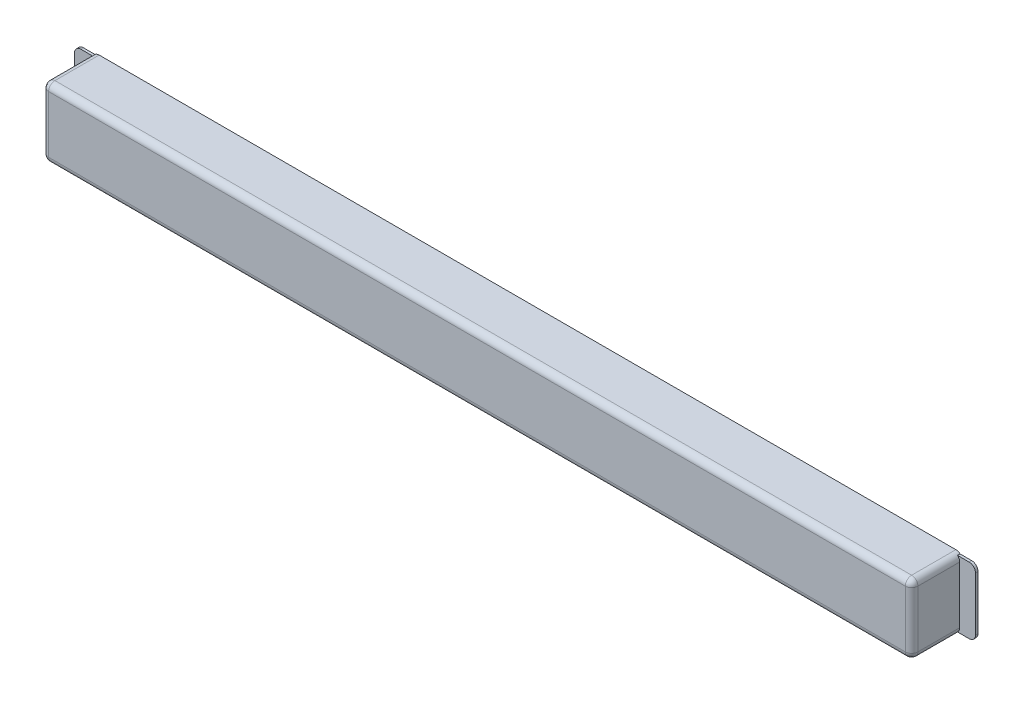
ISO-10303-21;
HEADER;
FILE_DESCRIPTION(('STEP AP214'),'2;1');
FILE_NAME('part.step','',(''),(''),'','','');
FILE_SCHEMA(('AUTOMOTIVE_DESIGN { 1 0 10303 214 1 1 1 1 }'));
ENDSEC;
DATA;
#1=APPLICATION_CONTEXT('core data for automotive mechanical design processes');
#2=APPLICATION_PROTOCOL_DEFINITION('international standard','automotive_design',2000,#1);
#3=PRODUCT_CONTEXT('',#1,'mechanical');
#4=PRODUCT('Part','Part','',(#3));
#5=PRODUCT_RELATED_PRODUCT_CATEGORY('part','',(#4));
#6=PRODUCT_DEFINITION_FORMATION('','',#4);
#7=PRODUCT_DEFINITION_CONTEXT('part definition',#1,'design');
#8=PRODUCT_DEFINITION('design','',#6,#7);
#9=PRODUCT_DEFINITION_SHAPE('','',#8);
#10=(LENGTH_UNIT() NAMED_UNIT(*) SI_UNIT(.MILLI.,.METRE.));
#11=(NAMED_UNIT(*) PLANE_ANGLE_UNIT() SI_UNIT($,.RADIAN.));
#12=(NAMED_UNIT(*) SI_UNIT($,.STERADIAN.) SOLID_ANGLE_UNIT());
#13=UNCERTAINTY_MEASURE_WITH_UNIT(LENGTH_MEASURE(1.E-05),#10,'distance_accuracy_value','');
#14=(GEOMETRIC_REPRESENTATION_CONTEXT(3) GLOBAL_UNCERTAINTY_ASSIGNED_CONTEXT((#13)) GLOBAL_UNIT_ASSIGNED_CONTEXT((#10,
#11,#12)) REPRESENTATION_CONTEXT('',''));
#15=CARTESIAN_POINT('',(0.,0.,0.));
#16=DIRECTION('',(0.,0.,1.));
#17=DIRECTION('',(1.,0.,0.));
#18=AXIS2_PLACEMENT_3D('',#15,#16,#17);
#19=CARTESIAN_POINT('',(-687.5,55.,80.));
#20=DIRECTION('',(1.,0.,0.));
#21=DIRECTION('',(0.,0.,-1.));
#22=AXIS2_PLACEMENT_3D('',#19,#20,#21);
#23=PLANE('',#22);
#24=DIRECTION('',(0.,-1.,0.));
#25=VECTOR('',#24,1.);
#26=CARTESIAN_POINT('',(-687.5,55.,4.));
#27=LINE('',#26,#25);
#28=CARTESIAN_POINT('',(-687.5,45.,4.));
#29=VERTEX_POINT('',#28);
#30=CARTESIAN_POINT('',(-687.5,-45.,4.));
#31=VERTEX_POINT('',#30);
#32=EDGE_CURVE('E244',#29,#31,#27,.T.);
#33=ORIENTED_EDGE('',*,*,#32,.T.);
#34=DIRECTION('',(0.,0.,-1.));
#35=VECTOR('',#34,1.);
#36=CARTESIAN_POINT('',(-687.5,-45.,80.));
#37=LINE('',#36,#35);
#38=CARTESIAN_POINT('',(-687.5,-45.,70.));
#39=VERTEX_POINT('',#38);
#40=EDGE_CURVE('E303',#31,#39,#37,.F.);
#41=ORIENTED_EDGE('',*,*,#40,.T.);
#42=DIRECTION('',(0.,-1.,0.));
#43=VECTOR('',#42,1.);
#44=CARTESIAN_POINT('',(-687.5,55.,70.));
#45=LINE('',#44,#43);
#46=CARTESIAN_POINT('',(-687.5,45.,70.));
#47=VERTEX_POINT('',#46);
#48=EDGE_CURVE('E300',#39,#47,#45,.F.);
#49=ORIENTED_EDGE('',*,*,#48,.T.);
#50=DIRECTION('',(0.,0.,-1.));
#51=VECTOR('',#50,1.);
#52=CARTESIAN_POINT('',(-687.5,45.,80.));
#53=LINE('',#52,#51);
#54=EDGE_CURVE('E297',#47,#29,#53,.T.);
#55=ORIENTED_EDGE('',*,*,#54,.T.);
#56=EDGE_LOOP('',(#33,#41,#49,#55));
#57=FACE_BOUND('',#56,.T.);
#58=ADVANCED_FACE('F41',(#57),#23,.F.);
#59=CARTESIAN_POINT('',(687.5,55.,80.));
#60=DIRECTION('',(-1.,0.,0.));
#61=DIRECTION('',(0.,0.,1.));
#62=AXIS2_PLACEMENT_3D('',#59,#60,#61);
#63=PLANE('',#62);
#64=DIRECTION('',(0.,1.,0.));
#65=VECTOR('',#64,1.);
#66=CARTESIAN_POINT('',(687.5,-55.,70.));
#67=LINE('',#66,#65);
#68=CARTESIAN_POINT('',(687.5,45.,70.));
#69=VERTEX_POINT('',#68);
#70=CARTESIAN_POINT('',(687.5,-45.,70.));
#71=VERTEX_POINT('',#70);
#72=EDGE_CURVE('E318',#69,#71,#67,.F.);
#73=ORIENTED_EDGE('',*,*,#72,.T.);
#74=DIRECTION('',(0.,0.,-1.));
#75=VECTOR('',#74,1.);
#76=CARTESIAN_POINT('',(687.5,-45.,80.));
#77=LINE('',#76,#75);
#78=CARTESIAN_POINT('',(687.5,-45.,4.));
#79=VERTEX_POINT('',#78);
#80=EDGE_CURVE('E321',#71,#79,#77,.T.);
#81=ORIENTED_EDGE('',*,*,#80,.T.);
#82=DIRECTION('',(0.,1.,0.));
#83=VECTOR('',#82,1.);
#84=CARTESIAN_POINT('',(687.5,55.,4.));
#85=LINE('',#84,#83);
#86=CARTESIAN_POINT('',(687.5,45.,4.));
#87=VERTEX_POINT('',#86);
#88=EDGE_CURVE('E221',#79,#87,#85,.T.);
#89=ORIENTED_EDGE('',*,*,#88,.T.);
#90=DIRECTION('',(0.,0.,-1.));
#91=VECTOR('',#90,1.);
#92=CARTESIAN_POINT('',(687.5,45.,80.));
#93=LINE('',#92,#91);
#94=EDGE_CURVE('E315',#87,#69,#93,.F.);
#95=ORIENTED_EDGE('',*,*,#94,.T.);
#96=EDGE_LOOP('',(#73,#81,#89,#95));
#97=FACE_BOUND('',#96,.T.);
#98=ADVANCED_FACE('F530',(#97),#63,.F.);
#99=CARTESIAN_POINT('',(-687.5,55.,80.));
#100=DIRECTION('',(0.,-1.,0.));
#101=DIRECTION('',(0.,0.,-1.));
#102=AXIS2_PLACEMENT_3D('',#99,#100,#101);
#103=PLANE('',#102);
#104=DIRECTION('',(-1.,0.,0.));
#105=VECTOR('',#104,1.);
#106=CARTESIAN_POINT('',(687.5,55.,70.));
#107=LINE('',#106,#105);
#108=CARTESIAN_POINT('',(-677.5,55.,70.));
#109=VERTEX_POINT('',#108);
#110=CARTESIAN_POINT('',(677.5,55.,70.));
#111=VERTEX_POINT('',#110);
#112=EDGE_CURVE('E309',#109,#111,#107,.F.);
#113=ORIENTED_EDGE('',*,*,#112,.T.);
#114=DIRECTION('',(0.,0.,-1.));
#115=VECTOR('',#114,1.);
#116=CARTESIAN_POINT('',(677.5,55.,80.));
#117=LINE('',#116,#115);
#118=CARTESIAN_POINT('',(677.5,55.,0.));
#119=VERTEX_POINT('',#118);
#120=EDGE_CURVE('E312',#111,#119,#117,.T.);
#121=ORIENTED_EDGE('',*,*,#120,.T.);
#122=DIRECTION('',(-1.,0.,0.));
#123=VECTOR('',#122,1.);
#124=CARTESIAN_POINT('',(-687.5,55.,0.));
#125=LINE('',#124,#123);
#126=CARTESIAN_POINT('',(-677.5,55.,0.));
#127=VERTEX_POINT('',#126);
#128=EDGE_CURVE('E433',#119,#127,#125,.T.);
#129=ORIENTED_EDGE('',*,*,#128,.T.);
#130=DIRECTION('',(0.,0.,-1.));
#131=VECTOR('',#130,1.);
#132=CARTESIAN_POINT('',(-677.5,55.,80.));
#133=LINE('',#132,#131);
#134=EDGE_CURVE('E306',#127,#109,#133,.F.);
#135=ORIENTED_EDGE('',*,*,#134,.T.);
#136=EDGE_LOOP('',(#113,#121,#129,#135));
#137=FACE_BOUND('',#136,.T.);
#138=ADVANCED_FACE('F516',(#137),#103,.F.);
#139=CARTESIAN_POINT('',(-687.5,-55.,80.));
#140=DIRECTION('',(0.,1.,0.));
#141=DIRECTION('',(0.,0.,1.));
#142=AXIS2_PLACEMENT_3D('',#139,#140,#141);
#143=PLANE('',#142);
#144=DIRECTION('',(1.,0.,0.));
#145=VECTOR('',#144,1.);
#146=CARTESIAN_POINT('',(-687.5,-55.,0.));
#147=LINE('',#146,#145);
#148=CARTESIAN_POINT('',(-677.5,-55.,0.));
#149=VERTEX_POINT('',#148);
#150=CARTESIAN_POINT('',(677.5,-55.,0.));
#151=VERTEX_POINT('',#150);
#152=EDGE_CURVE('E227',#149,#151,#147,.T.);
#153=ORIENTED_EDGE('',*,*,#152,.T.);
#154=DIRECTION('',(0.,0.,-1.));
#155=VECTOR('',#154,1.);
#156=CARTESIAN_POINT('',(677.5,-55.,80.));
#157=LINE('',#156,#155);
#158=CARTESIAN_POINT('',(677.5,-55.,70.));
#159=VERTEX_POINT('',#158);
#160=EDGE_CURVE('E294',#151,#159,#157,.F.);
#161=ORIENTED_EDGE('',*,*,#160,.T.);
#162=DIRECTION('',(1.,0.,0.));
#163=VECTOR('',#162,1.);
#164=CARTESIAN_POINT('',(-687.5,-55.,70.));
#165=LINE('',#164,#163);
#166=CARTESIAN_POINT('',(-677.5,-55.,70.));
#167=VERTEX_POINT('',#166);
#168=EDGE_CURVE('E290',#159,#167,#165,.F.);
#169=ORIENTED_EDGE('',*,*,#168,.T.);
#170=DIRECTION('',(0.,0.,-1.));
#171=VECTOR('',#170,1.);
#172=CARTESIAN_POINT('',(-677.5,-55.,80.));
#173=LINE('',#172,#171);
#174=EDGE_CURVE('E287',#167,#149,#173,.T.);
#175=ORIENTED_EDGE('',*,*,#174,.T.);
#176=EDGE_LOOP('',(#153,#161,#169,#175));
#177=FACE_BOUND('',#176,.T.);
#178=ADVANCED_FACE('F446',(#177),#143,.F.);
#179=CARTESIAN_POINT('',(0.,0.,80.));
#180=DIRECTION('',(0.,0.,1.));
#181=DIRECTION('',(1.,0.,0.));
#182=AXIS2_PLACEMENT_3D('',#179,#180,#181);
#183=PLANE('',#182);
#184=DIRECTION('',(0.,-1.,0.));
#185=VECTOR('',#184,1.);
#186=CARTESIAN_POINT('',(-677.5,-55.,80.));
#187=LINE('',#186,#185);
#188=CARTESIAN_POINT('',(-677.5,45.,80.));
#189=VERTEX_POINT('',#188);
#190=CARTESIAN_POINT('',(-677.5,-45.,80.));
#191=VERTEX_POINT('',#190);
#192=EDGE_CURVE('E280',#189,#191,#187,.T.);
#193=ORIENTED_EDGE('',*,*,#192,.T.);
#194=DIRECTION('',(1.,0.,0.));
#195=VECTOR('',#194,1.);
#196=CARTESIAN_POINT('',(687.5,-45.,80.));
#197=LINE('',#196,#195);
#198=CARTESIAN_POINT('',(677.5,-45.,80.));
#199=VERTEX_POINT('',#198);
#200=EDGE_CURVE('E283',#191,#199,#197,.T.);
#201=ORIENTED_EDGE('',*,*,#200,.T.);
#202=DIRECTION('',(0.,1.,0.));
#203=VECTOR('',#202,1.);
#204=CARTESIAN_POINT('',(677.5,55.,80.));
#205=LINE('',#204,#203);
#206=CARTESIAN_POINT('',(677.5,45.,80.));
#207=VERTEX_POINT('',#206);
#208=EDGE_CURVE('E274',#199,#207,#205,.T.);
#209=ORIENTED_EDGE('',*,*,#208,.T.);
#210=DIRECTION('',(-1.,0.,0.));
#211=VECTOR('',#210,1.);
#212=CARTESIAN_POINT('',(-687.5,45.,80.));
#213=LINE('',#212,#211);
#214=EDGE_CURVE('E277',#207,#189,#213,.T.);
#215=ORIENTED_EDGE('',*,*,#214,.T.);
#216=EDGE_LOOP('',(#193,#201,#209,#215));
#217=FACE_BOUND('',#216,.T.);
#218=ADVANCED_FACE('F472',(#217),#183,.T.);
#219=CARTESIAN_POINT('',(0.,0.,0.));
#220=DIRECTION('',(0.,0.,1.));
#221=DIRECTION('',(1.,0.,0.));
#222=AXIS2_PLACEMENT_3D('',#219,#220,#221);
#223=PLANE('',#222);
#224=DIRECTION('',(-1.,0.,0.));
#225=VECTOR('',#224,1.);
#226=CARTESIAN_POINT('',(662.5,-52.5000000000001,0.));
#227=LINE('',#226,#225);
#228=CARTESIAN_POINT('',(702.5,-52.5000000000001,0.));
#229=VERTEX_POINT('',#228);
#230=CARTESIAN_POINT('',(684.114378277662,-52.5000000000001,0.));
#231=VERTEX_POINT('',#230);
#232=EDGE_CURVE('E215',#229,#231,#227,.T.);
#233=ORIENTED_EDGE('',*,*,#232,.T.);
#234=CARTESIAN_POINT('',(677.5,-45.,0.));
#235=DIRECTION('',(0.,0.,1.));
#236=DIRECTION('',(1.,0.,0.));
#237=AXIS2_PLACEMENT_3D('',#234,#235,#236);
#238=CIRCLE('',#237,10.);
#239=EDGE_CURVE('E334',#231,#151,#238,.F.);
#240=ORIENTED_EDGE('',*,*,#239,.T.);
#241=ORIENTED_EDGE('',*,*,#152,.F.);
#242=CARTESIAN_POINT('',(-677.5,-45.,0.));
#243=DIRECTION('',(0.,0.,1.));
#244=DIRECTION('',(1.,0.,0.));
#245=AXIS2_PLACEMENT_3D('',#242,#243,#244);
#246=CIRCLE('',#245,10.);
#247=CARTESIAN_POINT('',(-684.114378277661,-52.5000000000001,0.));
#248=VERTEX_POINT('',#247);
#249=EDGE_CURVE('E327',#149,#248,#246,.F.);
#250=ORIENTED_EDGE('',*,*,#249,.T.);
#251=DIRECTION('',(1.,0.,0.));
#252=VECTOR('',#251,1.);
#253=CARTESIAN_POINT('',(-662.5,-52.5000000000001,0.));
#254=LINE('',#253,#252);
#255=CARTESIAN_POINT('',(-702.5,-52.5000000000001,0.));
#256=VERTEX_POINT('',#255);
#257=EDGE_CURVE('E416',#256,#248,#254,.T.);
#258=ORIENTED_EDGE('',*,*,#257,.F.);
#259=CARTESIAN_POINT('',(-702.5,-42.5000000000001,0.));
#260=DIRECTION('',(0.,0.,1.));
#261=DIRECTION('',(1.,0.,0.));
#262=AXIS2_PLACEMENT_3D('',#259,#260,#261);
#263=CIRCLE('',#262,10.);
#264=CARTESIAN_POINT('',(-712.5,-42.5000000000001,0.));
#265=VERTEX_POINT('',#264);
#266=EDGE_CURVE('E255',#256,#265,#263,.F.);
#267=ORIENTED_EDGE('',*,*,#266,.T.);
#268=DIRECTION('',(0.,-1.,0.));
#269=VECTOR('',#268,1.);
#270=CARTESIAN_POINT('',(-712.5,52.4999999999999,0.));
#271=LINE('',#270,#269);
#272=CARTESIAN_POINT('',(-712.5,42.4999999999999,0.));
#273=VERTEX_POINT('',#272);
#274=EDGE_CURVE('E405',#273,#265,#271,.T.);
#275=ORIENTED_EDGE('',*,*,#274,.F.);
#276=CARTESIAN_POINT('',(-702.5,42.4999999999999,0.));
#277=DIRECTION('',(0.,0.,1.));
#278=DIRECTION('',(1.,0.,0.));
#279=AXIS2_PLACEMENT_3D('',#276,#277,#278);
#280=CIRCLE('',#279,10.);
#281=CARTESIAN_POINT('',(-702.5,52.4999999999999,0.));
#282=VERTEX_POINT('',#281);
#283=EDGE_CURVE('E252',#273,#282,#280,.F.);
#284=ORIENTED_EDGE('',*,*,#283,.T.);
#285=DIRECTION('',(-1.,0.,0.));
#286=VECTOR('',#285,1.);
#287=CARTESIAN_POINT('',(-662.5,52.4999999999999,0.));
#288=LINE('',#287,#286);
#289=CARTESIAN_POINT('',(-684.114378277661,52.4999999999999,0.));
#290=VERTEX_POINT('',#289);
#291=EDGE_CURVE('E409',#290,#282,#288,.T.);
#292=ORIENTED_EDGE('',*,*,#291,.F.);
#293=CARTESIAN_POINT('',(-677.5,45.,0.));
#294=DIRECTION('',(0.,0.,1.));
#295=DIRECTION('',(1.,0.,0.));
#296=AXIS2_PLACEMENT_3D('',#293,#294,#295);
#297=CIRCLE('',#296,10.);
#298=EDGE_CURVE('E324',#290,#127,#297,.F.);
#299=ORIENTED_EDGE('',*,*,#298,.T.);
#300=ORIENTED_EDGE('',*,*,#128,.F.);
#301=CARTESIAN_POINT('',(677.5,45.,0.));
#302=DIRECTION('',(0.,0.,1.));
#303=DIRECTION('',(1.,0.,0.));
#304=AXIS2_PLACEMENT_3D('',#301,#302,#303);
#305=CIRCLE('',#304,10.);
#306=CARTESIAN_POINT('',(684.114378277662,52.4999999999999,0.));
#307=VERTEX_POINT('',#306);
#308=EDGE_CURVE('E331',#119,#307,#305,.F.);
#309=ORIENTED_EDGE('',*,*,#308,.T.);
#310=DIRECTION('',(1.,0.,0.));
#311=VECTOR('',#310,1.);
#312=CARTESIAN_POINT('',(662.5,52.4999999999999,0.));
#313=LINE('',#312,#311);
#314=CARTESIAN_POINT('',(702.5,52.4999999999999,0.));
#315=VERTEX_POINT('',#314);
#316=EDGE_CURVE('E198',#307,#315,#313,.T.);
#317=ORIENTED_EDGE('',*,*,#316,.T.);
#318=CARTESIAN_POINT('',(702.5,42.4999999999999,0.));
#319=DIRECTION('',(0.,0.,1.));
#320=DIRECTION('',(1.,0.,0.));
#321=AXIS2_PLACEMENT_3D('',#318,#319,#320);
#322=CIRCLE('',#321,10.);
#323=CARTESIAN_POINT('',(712.5,42.4999999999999,0.));
#324=VERTEX_POINT('',#323);
#325=EDGE_CURVE('E193',#315,#324,#322,.F.);
#326=ORIENTED_EDGE('',*,*,#325,.T.);
#327=DIRECTION('',(0.,-1.,0.));
#328=VECTOR('',#327,1.);
#329=CARTESIAN_POINT('',(712.5,52.4999999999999,0.));
#330=LINE('',#329,#328);
#331=CARTESIAN_POINT('',(712.5,-42.5000000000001,0.));
#332=VERTEX_POINT('',#331);
#333=EDGE_CURVE('E196',#324,#332,#330,.T.);
#334=ORIENTED_EDGE('',*,*,#333,.T.);
#335=CARTESIAN_POINT('',(702.5,-42.5000000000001,0.));
#336=DIRECTION('',(0.,0.,1.));
#337=DIRECTION('',(1.,0.,0.));
#338=AXIS2_PLACEMENT_3D('',#335,#336,#337);
#339=CIRCLE('',#338,10.);
#340=EDGE_CURVE('E204',#332,#229,#339,.F.);
#341=ORIENTED_EDGE('',*,*,#340,.T.);
#342=EDGE_LOOP('',(#233,#240,#241,#250,#258,#267,#275,#284,#292,#299,#300,#309,#317,#326,#334,#341));
#343=FACE_BOUND('',#342,.T.);
#344=ADVANCED_FACE('F195',(#343),#223,.F.);
#345=CARTESIAN_POINT('',(0.,0.,4.));
#346=DIRECTION('',(0.,0.,1.));
#347=DIRECTION('',(1.,0.,0.));
#348=AXIS2_PLACEMENT_3D('',#345,#346,#347);
#349=PLANE('',#348);
#350=DIRECTION('',(-1.,0.,0.));
#351=VECTOR('',#350,1.);
#352=CARTESIAN_POINT('',(662.5,-52.5000000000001,4.));
#353=LINE('',#352,#351);
#354=CARTESIAN_POINT('',(702.5,-52.5000000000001,4.));
#355=VERTEX_POINT('',#354);
#356=CARTESIAN_POINT('',(684.114378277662,-52.5000000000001,4.));
#357=VERTEX_POINT('',#356);
#358=EDGE_CURVE('E427',#355,#357,#353,.T.);
#359=ORIENTED_EDGE('',*,*,#358,.F.);
#360=CARTESIAN_POINT('',(702.5,-42.5000000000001,4.));
#361=DIRECTION('',(0.,0.,1.));
#362=DIRECTION('',(1.,0.,0.));
#363=AXIS2_PLACEMENT_3D('',#360,#361,#362);
#364=CIRCLE('',#363,10.);
#365=CARTESIAN_POINT('',(712.5,-42.5000000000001,4.));
#366=VERTEX_POINT('',#365);
#367=EDGE_CURVE('E238',#355,#366,#364,.T.);
#368=ORIENTED_EDGE('',*,*,#367,.T.);
#369=DIRECTION('',(0.,-1.,0.));
#370=VECTOR('',#369,1.);
#371=CARTESIAN_POINT('',(712.5,52.4999999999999,4.));
#372=LINE('',#371,#370);
#373=CARTESIAN_POINT('',(712.5,42.4999999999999,4.));
#374=VERTEX_POINT('',#373);
#375=EDGE_CURVE('E424',#374,#366,#372,.T.);
#376=ORIENTED_EDGE('',*,*,#375,.F.);
#377=CARTESIAN_POINT('',(702.5,42.4999999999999,4.));
#378=DIRECTION('',(0.,0.,1.));
#379=DIRECTION('',(1.,0.,0.));
#380=AXIS2_PLACEMENT_3D('',#377,#378,#379);
#381=CIRCLE('',#380,10.);
#382=CARTESIAN_POINT('',(702.5,52.4999999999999,4.));
#383=VERTEX_POINT('',#382);
#384=EDGE_CURVE('E219',#374,#383,#381,.T.);
#385=ORIENTED_EDGE('',*,*,#384,.T.);
#386=DIRECTION('',(1.,0.,0.));
#387=VECTOR('',#386,1.);
#388=CARTESIAN_POINT('',(662.5,52.4999999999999,4.));
#389=LINE('',#388,#387);
#390=CARTESIAN_POINT('',(684.114378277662,52.4999999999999,4.));
#391=VERTEX_POINT('',#390);
#392=EDGE_CURVE('E430',#391,#383,#389,.T.);
#393=ORIENTED_EDGE('',*,*,#392,.F.);
#394=CARTESIAN_POINT('',(677.5,45.,4.));
#395=DIRECTION('',(0.,0.,1.));
#396=DIRECTION('',(1.,0.,0.));
#397=AXIS2_PLACEMENT_3D('',#394,#395,#396);
#398=CIRCLE('',#397,10.);
#399=EDGE_CURVE('E349',#391,#87,#398,.F.);
#400=ORIENTED_EDGE('',*,*,#399,.T.);
#401=ORIENTED_EDGE('',*,*,#88,.F.);
#402=CARTESIAN_POINT('',(677.5,-45.,4.));
#403=DIRECTION('',(0.,0.,1.));
#404=DIRECTION('',(1.,0.,0.));
#405=AXIS2_PLACEMENT_3D('',#402,#403,#404);
#406=CIRCLE('',#405,10.);
#407=EDGE_CURVE('E337',#79,#357,#406,.F.);
#408=ORIENTED_EDGE('',*,*,#407,.T.);
#409=EDGE_LOOP('',(#359,#368,#376,#385,#393,#400,#401,#408));
#410=FACE_BOUND('',#409,.T.);
#411=ADVANCED_FACE('F535',(#410),#349,.T.);
#412=CARTESIAN_POINT('',(662.5,52.4999999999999,4.));
#413=DIRECTION('',(0.,1.,0.));
#414=DIRECTION('',(-1.,0.,0.));
#415=AXIS2_PLACEMENT_3D('',#412,#413,#414);
#416=PLANE('',#415);
#417=ORIENTED_EDGE('',*,*,#392,.T.);
#418=DIRECTION('',(0.,0.,-1.));
#419=VECTOR('',#418,1.);
#420=CARTESIAN_POINT('',(702.5,52.4999999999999,4.));
#421=LINE('',#420,#419);
#422=EDGE_CURVE('E241',#383,#315,#421,.T.);
#423=ORIENTED_EDGE('',*,*,#422,.T.);
#424=ORIENTED_EDGE('',*,*,#316,.F.);
#425=DIRECTION('',(0.,0.,-1.));
#426=VECTOR('',#425,1.);
#427=CARTESIAN_POINT('',(684.114378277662,52.4999999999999,0.));
#428=LINE('',#427,#426);
#429=EDGE_CURVE('E345',#307,#391,#428,.F.);
#430=ORIENTED_EDGE('',*,*,#429,.T.);
#431=EDGE_LOOP('',(#417,#423,#424,#430));
#432=FACE_BOUND('',#431,.T.);
#433=ADVANCED_FACE('F537',(#432),#416,.T.);
#434=CARTESIAN_POINT('',(662.5,-52.5000000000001,4.));
#435=DIRECTION('',(0.,-1.,0.));
#436=DIRECTION('',(0.,0.,-1.));
#437=AXIS2_PLACEMENT_3D('',#434,#435,#436);
#438=PLANE('',#437);
#439=ORIENTED_EDGE('',*,*,#232,.F.);
#440=DIRECTION('',(0.,0.,-1.));
#441=VECTOR('',#440,1.);
#442=CARTESIAN_POINT('',(702.5,-52.5000000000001,4.));
#443=LINE('',#442,#441);
#444=EDGE_CURVE('E233',#229,#355,#443,.F.);
#445=ORIENTED_EDGE('',*,*,#444,.T.);
#446=ORIENTED_EDGE('',*,*,#358,.T.);
#447=DIRECTION('',(0.,0.,-1.));
#448=VECTOR('',#447,1.);
#449=CARTESIAN_POINT('',(684.114378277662,-52.5000000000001,4.));
#450=LINE('',#449,#448);
#451=EDGE_CURVE('E341',#357,#231,#450,.T.);
#452=ORIENTED_EDGE('',*,*,#451,.T.);
#453=EDGE_LOOP('',(#439,#445,#446,#452));
#454=FACE_BOUND('',#453,.T.);
#455=ADVANCED_FACE('F539',(#454),#438,.T.);
#456=CARTESIAN_POINT('',(712.5,52.4999999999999,4.));
#457=DIRECTION('',(1.,0.,0.));
#458=DIRECTION('',(0.,0.,-1.));
#459=AXIS2_PLACEMENT_3D('',#456,#457,#458);
#460=PLANE('',#459);
#461=ORIENTED_EDGE('',*,*,#375,.T.);
#462=DIRECTION('',(0.,0.,-1.));
#463=VECTOR('',#462,1.);
#464=CARTESIAN_POINT('',(712.5,-42.5000000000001,4.));
#465=LINE('',#464,#463);
#466=EDGE_CURVE('E205',#366,#332,#465,.T.);
#467=ORIENTED_EDGE('',*,*,#466,.T.);
#468=ORIENTED_EDGE('',*,*,#333,.F.);
#469=DIRECTION('',(0.,0.,-1.));
#470=VECTOR('',#469,1.);
#471=CARTESIAN_POINT('',(712.5,42.4999999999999,4.));
#472=LINE('',#471,#470);
#473=EDGE_CURVE('E211',#324,#374,#472,.F.);
#474=ORIENTED_EDGE('',*,*,#473,.T.);
#475=EDGE_LOOP('',(#461,#467,#468,#474));
#476=FACE_BOUND('',#475,.T.);
#477=ADVANCED_FACE('F210',(#476),#460,.T.);
#478=CARTESIAN_POINT('',(702.5,-42.5000000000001,4.));
#479=DIRECTION('',(0.,0.,-1.));
#480=DIRECTION('',(-1.,0.,0.));
#481=AXIS2_PLACEMENT_3D('',#478,#479,#480);
#482=CYLINDRICAL_SURFACE('',#481,10.);
#483=ORIENTED_EDGE('',*,*,#367,.F.);
#484=ORIENTED_EDGE('',*,*,#444,.F.);
#485=ORIENTED_EDGE('',*,*,#340,.F.);
#486=ORIENTED_EDGE('',*,*,#466,.F.);
#487=EDGE_LOOP('',(#483,#484,#485,#486));
#488=FACE_BOUND('',#487,.T.);
#489=ADVANCED_FACE('F560',(#488),#482,.T.);
#490=CARTESIAN_POINT('',(702.5,42.4999999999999,4.));
#491=DIRECTION('',(0.,0.,-1.));
#492=DIRECTION('',(-1.,0.,0.));
#493=AXIS2_PLACEMENT_3D('',#490,#491,#492);
#494=CYLINDRICAL_SURFACE('',#493,10.);
#495=ORIENTED_EDGE('',*,*,#384,.F.);
#496=ORIENTED_EDGE('',*,*,#473,.F.);
#497=ORIENTED_EDGE('',*,*,#325,.F.);
#498=ORIENTED_EDGE('',*,*,#422,.F.);
#499=EDGE_LOOP('',(#495,#496,#497,#498));
#500=FACE_BOUND('',#499,.T.);
#501=ADVANCED_FACE('F218',(#500),#494,.T.);
#502=CARTESIAN_POINT('',(0.,0.,4.));
#503=DIRECTION('',(0.,0.,1.));
#504=DIRECTION('',(-1.,0.,0.));
#505=AXIS2_PLACEMENT_3D('',#502,#503,#504);
#506=PLANE('',#505);
#507=DIRECTION('',(0.,-1.,0.));
#508=VECTOR('',#507,1.);
#509=CARTESIAN_POINT('',(-712.5,52.4999999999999,4.));
#510=LINE('',#509,#508);
#511=CARTESIAN_POINT('',(-712.5,42.4999999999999,4.));
#512=VERTEX_POINT('',#511);
#513=CARTESIAN_POINT('',(-712.5,-42.5000000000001,4.));
#514=VERTEX_POINT('',#513);
#515=EDGE_CURVE('E423',#512,#514,#510,.T.);
#516=ORIENTED_EDGE('',*,*,#515,.T.);
#517=CARTESIAN_POINT('',(-702.5,-42.5000000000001,4.));
#518=DIRECTION('',(0.,0.,1.));
#519=DIRECTION('',(1.,0.,0.));
#520=AXIS2_PLACEMENT_3D('',#517,#518,#519);
#521=CIRCLE('',#520,10.);
#522=CARTESIAN_POINT('',(-702.5,-52.5000000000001,4.));
#523=VERTEX_POINT('',#522);
#524=EDGE_CURVE('E268',#514,#523,#521,.T.);
#525=ORIENTED_EDGE('',*,*,#524,.T.);
#526=DIRECTION('',(1.,0.,0.));
#527=VECTOR('',#526,1.);
#528=CARTESIAN_POINT('',(-662.5,-52.5000000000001,4.));
#529=LINE('',#528,#527);
#530=CARTESIAN_POINT('',(-684.114378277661,-52.5000000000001,4.));
#531=VERTEX_POINT('',#530);
#532=EDGE_CURVE('E66',#523,#531,#529,.T.);
#533=ORIENTED_EDGE('',*,*,#532,.T.);
#534=CARTESIAN_POINT('',(-677.5,-45.,4.));
#535=DIRECTION('',(0.,0.,1.));
#536=DIRECTION('',(1.,0.,0.));
#537=AXIS2_PLACEMENT_3D('',#534,#535,#536);
#538=CIRCLE('',#537,10.);
#539=EDGE_CURVE('E355',#531,#31,#538,.F.);
#540=ORIENTED_EDGE('',*,*,#539,.T.);
#541=ORIENTED_EDGE('',*,*,#32,.F.);
#542=CARTESIAN_POINT('',(-677.5,45.,4.));
#543=DIRECTION('',(0.,0.,1.));
#544=DIRECTION('',(1.,0.,0.));
#545=AXIS2_PLACEMENT_3D('',#542,#543,#544);
#546=CIRCLE('',#545,10.);
#547=CARTESIAN_POINT('',(-684.114378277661,52.4999999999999,4.));
#548=VERTEX_POINT('',#547);
#549=EDGE_CURVE('E51',#29,#548,#546,.F.);
#550=ORIENTED_EDGE('',*,*,#549,.T.);
#551=DIRECTION('',(-1.,0.,0.));
#552=VECTOR('',#551,1.);
#553=CARTESIAN_POINT('',(-662.5,52.4999999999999,4.));
#554=LINE('',#553,#552);
#555=CARTESIAN_POINT('',(-702.5,52.4999999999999,4.));
#556=VERTEX_POINT('',#555);
#557=EDGE_CURVE('E58',#548,#556,#554,.T.);
#558=ORIENTED_EDGE('',*,*,#557,.T.);
#559=CARTESIAN_POINT('',(-702.5,42.4999999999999,4.));
#560=DIRECTION('',(0.,0.,1.));
#561=DIRECTION('',(1.,0.,0.));
#562=AXIS2_PLACEMENT_3D('',#559,#560,#561);
#563=CIRCLE('',#562,10.);
#564=EDGE_CURVE('E265',#556,#512,#563,.T.);
#565=ORIENTED_EDGE('',*,*,#564,.T.);
#566=EDGE_LOOP('',(#516,#525,#533,#540,#541,#550,#558,#565));
#567=FACE_BOUND('',#566,.T.);
#568=ADVANCED_FACE('F497',(#567),#506,.T.);
#569=CARTESIAN_POINT('',(-662.5,-52.5000000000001,4.));
#570=DIRECTION('',(0.,1.,0.));
#571=DIRECTION('',(0.,0.,1.));
#572=AXIS2_PLACEMENT_3D('',#569,#570,#571);
#573=PLANE('',#572);
#574=ORIENTED_EDGE('',*,*,#532,.F.);
#575=DIRECTION('',(0.,0.,-1.));
#576=VECTOR('',#575,1.);
#577=CARTESIAN_POINT('',(-702.5,-52.5000000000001,4.));
#578=LINE('',#577,#576);
#579=EDGE_CURVE('E248',#523,#256,#578,.T.);
#580=ORIENTED_EDGE('',*,*,#579,.T.);
#581=ORIENTED_EDGE('',*,*,#257,.T.);
#582=DIRECTION('',(0.,0.,-1.));
#583=VECTOR('',#582,1.);
#584=CARTESIAN_POINT('',(-684.114378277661,-52.5000000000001,0.));
#585=LINE('',#584,#583);
#586=EDGE_CURVE('E352',#248,#531,#585,.F.);
#587=ORIENTED_EDGE('',*,*,#586,.T.);
#588=EDGE_LOOP('',(#574,#580,#581,#587));
#589=FACE_BOUND('',#588,.T.);
#590=ADVANCED_FACE('F488',(#589),#573,.F.);
#591=CARTESIAN_POINT('',(-662.5,52.4999999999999,4.));
#592=DIRECTION('',(0.,-1.,0.));
#593=DIRECTION('',(1.,0.,0.));
#594=AXIS2_PLACEMENT_3D('',#591,#592,#593);
#595=PLANE('',#594);
#596=ORIENTED_EDGE('',*,*,#291,.T.);
#597=DIRECTION('',(0.,0.,-1.));
#598=VECTOR('',#597,1.);
#599=CARTESIAN_POINT('',(-702.5,52.4999999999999,4.));
#600=LINE('',#599,#598);
#601=EDGE_CURVE('E271',#282,#556,#600,.F.);
#602=ORIENTED_EDGE('',*,*,#601,.T.);
#603=ORIENTED_EDGE('',*,*,#557,.F.);
#604=DIRECTION('',(0.,0.,-1.));
#605=VECTOR('',#604,1.);
#606=CARTESIAN_POINT('',(-684.114378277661,52.4999999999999,4.));
#607=LINE('',#606,#605);
#608=EDGE_CURVE('E11',#548,#290,#607,.T.);
#609=ORIENTED_EDGE('',*,*,#608,.T.);
#610=EDGE_LOOP('',(#596,#602,#603,#609));
#611=FACE_BOUND('',#610,.T.);
#612=ADVANCED_FACE('F509',(#611),#595,.F.);
#613=CARTESIAN_POINT('',(-712.5,52.4999999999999,4.));
#614=DIRECTION('',(1.,0.,0.));
#615=DIRECTION('',(0.,0.,-1.));
#616=AXIS2_PLACEMENT_3D('',#613,#614,#615);
#617=PLANE('',#616);
#618=ORIENTED_EDGE('',*,*,#274,.T.);
#619=DIRECTION('',(0.,0.,-1.));
#620=VECTOR('',#619,1.);
#621=CARTESIAN_POINT('',(-712.5,-42.5000000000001,4.));
#622=LINE('',#621,#620);
#623=EDGE_CURVE('E262',#265,#514,#622,.F.);
#624=ORIENTED_EDGE('',*,*,#623,.T.);
#625=ORIENTED_EDGE('',*,*,#515,.F.);
#626=DIRECTION('',(0.,0.,-1.));
#627=VECTOR('',#626,1.);
#628=CARTESIAN_POINT('',(-712.5,42.4999999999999,4.));
#629=LINE('',#628,#627);
#630=EDGE_CURVE('E258',#512,#273,#629,.T.);
#631=ORIENTED_EDGE('',*,*,#630,.T.);
#632=EDGE_LOOP('',(#618,#624,#625,#631));
#633=FACE_BOUND('',#632,.T.);
#634=ADVANCED_FACE('F495',(#633),#617,.F.);
#635=CARTESIAN_POINT('',(-702.5,-42.5000000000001,4.));
#636=DIRECTION('',(0.,0.,-1.));
#637=DIRECTION('',(-1.,0.,0.));
#638=AXIS2_PLACEMENT_3D('',#635,#636,#637);
#639=CYLINDRICAL_SURFACE('',#638,10.);
#640=ORIENTED_EDGE('',*,*,#524,.F.);
#641=ORIENTED_EDGE('',*,*,#623,.F.);
#642=ORIENTED_EDGE('',*,*,#266,.F.);
#643=ORIENTED_EDGE('',*,*,#579,.F.);
#644=EDGE_LOOP('',(#640,#641,#642,#643));
#645=FACE_BOUND('',#644,.T.);
#646=ADVANCED_FACE('F492',(#645),#639,.T.);
#647=CARTESIAN_POINT('',(-702.5,42.4999999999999,4.));
#648=DIRECTION('',(0.,0.,-1.));
#649=DIRECTION('',(-1.,0.,0.));
#650=AXIS2_PLACEMENT_3D('',#647,#648,#649);
#651=CYLINDRICAL_SURFACE('',#650,10.);
#652=ORIENTED_EDGE('',*,*,#564,.F.);
#653=ORIENTED_EDGE('',*,*,#601,.F.);
#654=ORIENTED_EDGE('',*,*,#283,.F.);
#655=ORIENTED_EDGE('',*,*,#630,.F.);
#656=EDGE_LOOP('',(#652,#653,#654,#655));
#657=FACE_BOUND('',#656,.T.);
#658=ADVANCED_FACE('F508',(#657),#651,.T.);
#659=CARTESIAN_POINT('',(-677.5,45.,80.));
#660=DIRECTION('',(0.,0.,-1.));
#661=DIRECTION('',(-1.,0.,0.));
#662=AXIS2_PLACEMENT_3D('',#659,#660,#661);
#663=CYLINDRICAL_SURFACE('',#662,10.);
#664=ORIENTED_EDGE('',*,*,#549,.F.);
#665=ORIENTED_EDGE('',*,*,#54,.F.);
#666=CARTESIAN_POINT('',(-677.5,45.,70.));
#667=DIRECTION('',(0.,0.,1.));
#668=DIRECTION('',(1.,0.,0.));
#669=AXIS2_PLACEMENT_3D('',#666,#667,#668);
#670=CIRCLE('',#669,10.);
#671=EDGE_CURVE('E45',#109,#47,#670,.T.);
#672=ORIENTED_EDGE('',*,*,#671,.F.);
#673=ORIENTED_EDGE('',*,*,#134,.F.);
#674=ORIENTED_EDGE('',*,*,#298,.F.);
#675=ORIENTED_EDGE('',*,*,#608,.F.);
#676=EDGE_LOOP('',(#664,#665,#672,#673,#674,#675));
#677=FACE_BOUND('',#676,.T.);
#678=ADVANCED_FACE('F43',(#677),#663,.T.);
#679=CARTESIAN_POINT('',(0.,45.,70.));
#680=DIRECTION('',(1.,0.,0.));
#681=DIRECTION('',(0.,0.,-1.));
#682=AXIS2_PLACEMENT_3D('',#679,#680,#681);
#683=CYLINDRICAL_SURFACE('',#682,10.);
#684=CARTESIAN_POINT('',(677.5,45.,70.));
#685=DIRECTION('',(1.,0.,0.));
#686=DIRECTION('',(0.,0.,-1.));
#687=AXIS2_PLACEMENT_3D('',#684,#685,#686);
#688=CIRCLE('',#687,10.);
#689=EDGE_CURVE('E394',#111,#207,#688,.T.);
#690=ORIENTED_EDGE('',*,*,#689,.F.);
#691=ORIENTED_EDGE('',*,*,#112,.F.);
#692=CARTESIAN_POINT('',(-677.5,45.,70.));
#693=DIRECTION('',(-1.,0.,0.));
#694=DIRECTION('',(0.,0.,1.));
#695=AXIS2_PLACEMENT_3D('',#692,#693,#694);
#696=CIRCLE('',#695,10.);
#697=EDGE_CURVE('E397',#189,#109,#696,.T.);
#698=ORIENTED_EDGE('',*,*,#697,.F.);
#699=ORIENTED_EDGE('',*,*,#214,.F.);
#700=EDGE_LOOP('',(#690,#691,#698,#699));
#701=FACE_BOUND('',#700,.T.);
#702=ADVANCED_FACE('F526',(#701),#683,.T.);
#703=CARTESIAN_POINT('',(677.5,45.,80.));
#704=DIRECTION('',(0.,0.,-1.));
#705=DIRECTION('',(-1.,0.,0.));
#706=AXIS2_PLACEMENT_3D('',#703,#704,#705);
#707=CYLINDRICAL_SURFACE('',#706,10.);
#708=ORIENTED_EDGE('',*,*,#308,.F.);
#709=ORIENTED_EDGE('',*,*,#120,.F.);
#710=CARTESIAN_POINT('',(677.5,45.,70.));
#711=DIRECTION('',(0.,0.,1.));
#712=DIRECTION('',(1.,0.,0.));
#713=AXIS2_PLACEMENT_3D('',#710,#711,#712);
#714=CIRCLE('',#713,10.);
#715=EDGE_CURVE('E390',#69,#111,#714,.T.);
#716=ORIENTED_EDGE('',*,*,#715,.F.);
#717=ORIENTED_EDGE('',*,*,#94,.F.);
#718=ORIENTED_EDGE('',*,*,#399,.F.);
#719=ORIENTED_EDGE('',*,*,#429,.F.);
#720=EDGE_LOOP('',(#708,#709,#716,#717,#718,#719));
#721=FACE_BOUND('',#720,.T.);
#722=ADVANCED_FACE('F522',(#721),#707,.T.);
#723=CARTESIAN_POINT('',(-677.5,45.,70.));
#724=DIRECTION('',(0.,0.,1.));
#725=DIRECTION('',(1.,0.,0.));
#726=AXIS2_PLACEMENT_3D('',#723,#724,#725);
#727=SPHERICAL_SURFACE('',#726,10.);
#728=ORIENTED_EDGE('',*,*,#697,.T.);
#729=ORIENTED_EDGE('',*,*,#671,.T.);
#730=CARTESIAN_POINT('',(-677.5,45.,70.));
#731=DIRECTION('',(0.,1.,0.));
#732=DIRECTION('',(0.,0.,1.));
#733=AXIS2_PLACEMENT_3D('',#730,#731,#732);
#734=CIRCLE('',#733,10.);
#735=EDGE_CURVE('E386',#189,#47,#734,.F.);
#736=ORIENTED_EDGE('',*,*,#735,.F.);
#737=EDGE_LOOP('',(#728,#729,#736));
#738=FACE_BOUND('',#737,.T.);
#739=ADVANCED_FACE('F586',(#738),#727,.T.);
#740=CARTESIAN_POINT('',(677.5,45.,70.));
#741=DIRECTION('',(0.,0.,1.));
#742=DIRECTION('',(1.,0.,0.));
#743=AXIS2_PLACEMENT_3D('',#740,#741,#742);
#744=SPHERICAL_SURFACE('',#743,10.);
#745=ORIENTED_EDGE('',*,*,#715,.T.);
#746=ORIENTED_EDGE('',*,*,#689,.T.);
#747=CARTESIAN_POINT('',(677.5,45.,70.));
#748=DIRECTION('',(0.,1.,0.));
#749=DIRECTION('',(0.,0.,1.));
#750=AXIS2_PLACEMENT_3D('',#747,#748,#749);
#751=CIRCLE('',#750,10.);
#752=EDGE_CURVE('E382',#69,#207,#751,.F.);
#753=ORIENTED_EDGE('',*,*,#752,.F.);
#754=EDGE_LOOP('',(#745,#746,#753));
#755=FACE_BOUND('',#754,.T.);
#756=ADVANCED_FACE('F528',(#755),#744,.T.);
#757=CARTESIAN_POINT('',(-677.5,-45.,80.));
#758=DIRECTION('',(0.,0.,-1.));
#759=DIRECTION('',(-1.,0.,0.));
#760=AXIS2_PLACEMENT_3D('',#757,#758,#759);
#761=CYLINDRICAL_SURFACE('',#760,10.);
#762=ORIENTED_EDGE('',*,*,#249,.F.);
#763=ORIENTED_EDGE('',*,*,#174,.F.);
#764=CARTESIAN_POINT('',(-677.5,-45.,70.));
#765=DIRECTION('',(0.,0.,1.));
#766=DIRECTION('',(1.,0.,0.));
#767=AXIS2_PLACEMENT_3D('',#764,#765,#766);
#768=CIRCLE('',#767,10.);
#769=EDGE_CURVE('E378',#39,#167,#768,.T.);
#770=ORIENTED_EDGE('',*,*,#769,.F.);
#771=ORIENTED_EDGE('',*,*,#40,.F.);
#772=ORIENTED_EDGE('',*,*,#539,.F.);
#773=ORIENTED_EDGE('',*,*,#586,.F.);
#774=EDGE_LOOP('',(#762,#763,#770,#771,#772,#773));
#775=FACE_BOUND('',#774,.T.);
#776=ADVANCED_FACE('F483',(#775),#761,.T.);
#777=CARTESIAN_POINT('',(-677.5,0.,70.));
#778=DIRECTION('',(0.,1.,0.));
#779=DIRECTION('',(0.,0.,1.));
#780=AXIS2_PLACEMENT_3D('',#777,#778,#779);
#781=CYLINDRICAL_SURFACE('',#780,10.);
#782=ORIENTED_EDGE('',*,*,#735,.T.);
#783=ORIENTED_EDGE('',*,*,#48,.F.);
#784=CARTESIAN_POINT('',(-677.5,-45.,70.));
#785=DIRECTION('',(0.,-1.,0.));
#786=DIRECTION('',(0.,0.,-1.));
#787=AXIS2_PLACEMENT_3D('',#784,#785,#786);
#788=CIRCLE('',#787,10.);
#789=EDGE_CURVE('E374',#191,#39,#788,.T.);
#790=ORIENTED_EDGE('',*,*,#789,.F.);
#791=ORIENTED_EDGE('',*,*,#192,.F.);
#792=EDGE_LOOP('',(#782,#783,#790,#791));
#793=FACE_BOUND('',#792,.T.);
#794=ADVANCED_FACE('F477',(#793),#781,.T.);
#795=CARTESIAN_POINT('',(677.5,0.,70.));
#796=DIRECTION('',(0.,-1.,0.));
#797=DIRECTION('',(0.,0.,-1.));
#798=AXIS2_PLACEMENT_3D('',#795,#796,#797);
#799=CYLINDRICAL_SURFACE('',#798,10.);
#800=ORIENTED_EDGE('',*,*,#752,.T.);
#801=ORIENTED_EDGE('',*,*,#208,.F.);
#802=CARTESIAN_POINT('',(677.5,-45.,70.));
#803=DIRECTION('',(0.,-1.,0.));
#804=DIRECTION('',(0.,0.,-1.));
#805=AXIS2_PLACEMENT_3D('',#802,#803,#804);
#806=CIRCLE('',#805,10.);
#807=EDGE_CURVE('E370',#71,#199,#806,.T.);
#808=ORIENTED_EDGE('',*,*,#807,.F.);
#809=ORIENTED_EDGE('',*,*,#72,.F.);
#810=EDGE_LOOP('',(#800,#801,#808,#809));
#811=FACE_BOUND('',#810,.T.);
#812=ADVANCED_FACE('F468',(#811),#799,.T.);
#813=CARTESIAN_POINT('',(677.5,-45.,80.));
#814=DIRECTION('',(0.,0.,-1.));
#815=DIRECTION('',(-1.,0.,0.));
#816=AXIS2_PLACEMENT_3D('',#813,#814,#815);
#817=CYLINDRICAL_SURFACE('',#816,10.);
#818=ORIENTED_EDGE('',*,*,#407,.F.);
#819=ORIENTED_EDGE('',*,*,#80,.F.);
#820=CARTESIAN_POINT('',(677.5,-45.,70.));
#821=DIRECTION('',(0.,0.,1.));
#822=DIRECTION('',(1.,0.,0.));
#823=AXIS2_PLACEMENT_3D('',#820,#821,#822);
#824=CIRCLE('',#823,10.);
#825=EDGE_CURVE('E366',#159,#71,#824,.T.);
#826=ORIENTED_EDGE('',*,*,#825,.F.);
#827=ORIENTED_EDGE('',*,*,#160,.F.);
#828=ORIENTED_EDGE('',*,*,#239,.F.);
#829=ORIENTED_EDGE('',*,*,#451,.F.);
#830=EDGE_LOOP('',(#818,#819,#826,#827,#828,#829));
#831=FACE_BOUND('',#830,.T.);
#832=ADVANCED_FACE('F453',(#831),#817,.T.);
#833=CARTESIAN_POINT('',(-677.5,-45.,70.));
#834=DIRECTION('',(0.,0.,1.));
#835=DIRECTION('',(1.,0.,0.));
#836=AXIS2_PLACEMENT_3D('',#833,#834,#835);
#837=SPHERICAL_SURFACE('',#836,10.);
#838=ORIENTED_EDGE('',*,*,#789,.T.);
#839=ORIENTED_EDGE('',*,*,#769,.T.);
#840=CARTESIAN_POINT('',(-677.5,-45.,70.));
#841=DIRECTION('',(-1.,0.,0.));
#842=DIRECTION('',(0.,0.,1.));
#843=AXIS2_PLACEMENT_3D('',#840,#841,#842);
#844=CIRCLE('',#843,10.);
#845=EDGE_CURVE('E363',#191,#167,#844,.F.);
#846=ORIENTED_EDGE('',*,*,#845,.F.);
#847=EDGE_LOOP('',(#838,#839,#846));
#848=FACE_BOUND('',#847,.T.);
#849=ADVANCED_FACE('F480',(#848),#837,.T.);
#850=CARTESIAN_POINT('',(677.5,-45.,70.));
#851=DIRECTION('',(0.,0.,1.));
#852=DIRECTION('',(1.,0.,0.));
#853=AXIS2_PLACEMENT_3D('',#850,#851,#852);
#854=SPHERICAL_SURFACE('',#853,10.);
#855=ORIENTED_EDGE('',*,*,#825,.T.);
#856=ORIENTED_EDGE('',*,*,#807,.T.);
#857=CARTESIAN_POINT('',(677.5,-45.,70.));
#858=DIRECTION('',(1.,0.,0.));
#859=DIRECTION('',(0.,0.,-1.));
#860=AXIS2_PLACEMENT_3D('',#857,#858,#859);
#861=CIRCLE('',#860,10.);
#862=EDGE_CURVE('E360',#159,#199,#861,.F.);
#863=ORIENTED_EDGE('',*,*,#862,.F.);
#864=EDGE_LOOP('',(#855,#856,#863));
#865=FACE_BOUND('',#864,.T.);
#866=ADVANCED_FACE('F464',(#865),#854,.T.);
#867=CARTESIAN_POINT('',(0.,-45.,70.));
#868=DIRECTION('',(-1.,0.,0.));
#869=DIRECTION('',(0.,0.,1.));
#870=AXIS2_PLACEMENT_3D('',#867,#868,#869);
#871=CYLINDRICAL_SURFACE('',#870,10.);
#872=ORIENTED_EDGE('',*,*,#845,.T.);
#873=ORIENTED_EDGE('',*,*,#168,.F.);
#874=ORIENTED_EDGE('',*,*,#862,.T.);
#875=ORIENTED_EDGE('',*,*,#200,.F.);
#876=EDGE_LOOP('',(#872,#873,#874,#875));
#877=FACE_BOUND('',#876,.T.);
#878=ADVANCED_FACE('F461',(#877),#871,.T.);
#879=CLOSED_SHELL('',(#58,#98,#138,#178,#218,#344,#411,#433,#455,#477,#489,#501,#568,#590,#612,
#634,#646,#658,#678,#702,#722,#739,#756,#776,#794,#812,#832,#849,#866,#878));
#880=MANIFOLD_SOLID_BREP('B2',#879);
#881=ADVANCED_BREP_SHAPE_REPRESENTATION('',(#18,#880),#14);
#882=SHAPE_DEFINITION_REPRESENTATION(#9,#881);
ENDSEC;
END-ISO-10303-21;
